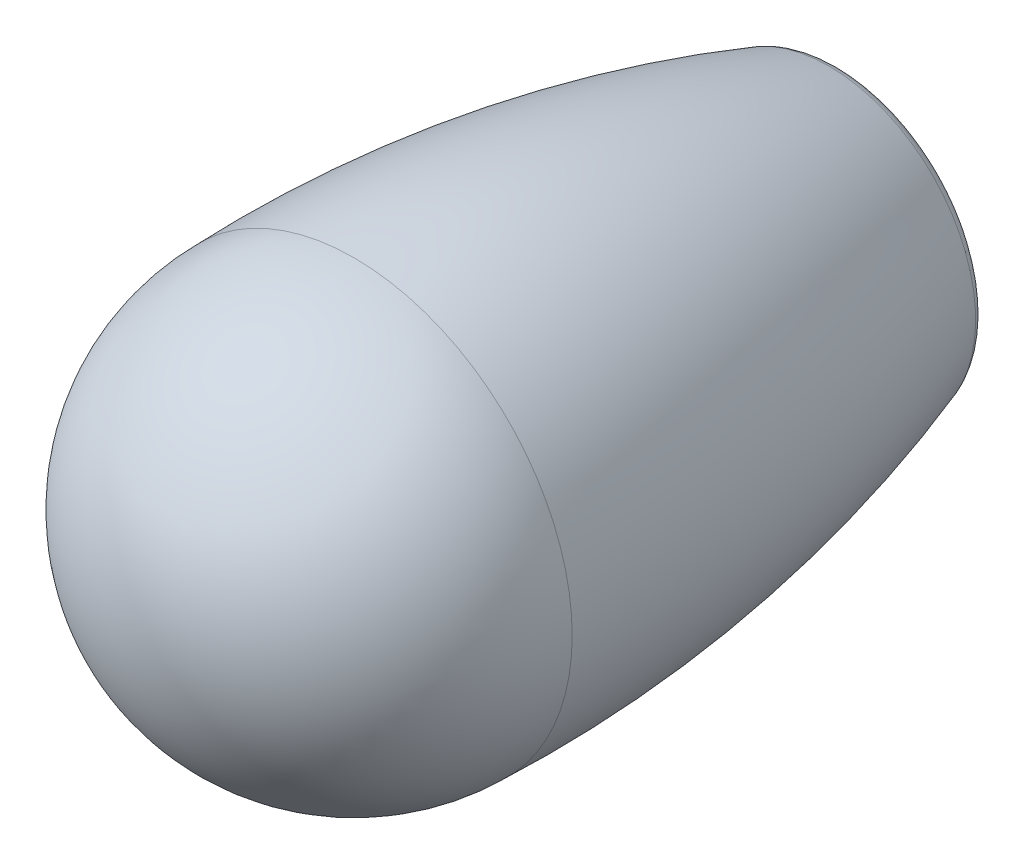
ISO-10303-21;
HEADER;
FILE_DESCRIPTION(('STEP AP214'),'2;1');
FILE_NAME('part.step','',(''),(''),'','','');
FILE_SCHEMA(('AUTOMOTIVE_DESIGN { 1 0 10303 214 1 1 1 1 }'));
ENDSEC;
DATA;
#1=APPLICATION_CONTEXT('core data for automotive mechanical design processes');
#2=APPLICATION_PROTOCOL_DEFINITION('international standard','automotive_design',2000,#1);
#3=PRODUCT_CONTEXT('',#1,'mechanical');
#4=PRODUCT('Part','Part','',(#3));
#5=PRODUCT_RELATED_PRODUCT_CATEGORY('part','',(#4));
#6=PRODUCT_DEFINITION_FORMATION('','',#4);
#7=PRODUCT_DEFINITION_CONTEXT('part definition',#1,'design');
#8=PRODUCT_DEFINITION('design','',#6,#7);
#9=PRODUCT_DEFINITION_SHAPE('','',#8);
#10=(LENGTH_UNIT() NAMED_UNIT(*) SI_UNIT(.MILLI.,.METRE.));
#11=(NAMED_UNIT(*) PLANE_ANGLE_UNIT() SI_UNIT($,.RADIAN.));
#12=(NAMED_UNIT(*) SI_UNIT($,.STERADIAN.) SOLID_ANGLE_UNIT());
#13=UNCERTAINTY_MEASURE_WITH_UNIT(LENGTH_MEASURE(1.E-05),#10,'distance_accuracy_value','');
#14=(GEOMETRIC_REPRESENTATION_CONTEXT(3) GLOBAL_UNCERTAINTY_ASSIGNED_CONTEXT((#13)) GLOBAL_UNIT_ASSIGNED_CONTEXT((#10,
#11,#12)) REPRESENTATION_CONTEXT('',''));
#15=CARTESIAN_POINT('',(0.,0.,0.));
#16=DIRECTION('',(0.,0.,1.));
#17=DIRECTION('',(1.,0.,0.));
#18=AXIS2_PLACEMENT_3D('',#15,#16,#17);
#19=CARTESIAN_POINT('',(0.,0.,1.));
#20=DIRECTION('',(0.,0.,-1.));
#21=DIRECTION('',(0.,1.,0.));
#22=AXIS2_PLACEMENT_3D('',#19,#20,#21);
#23=TOROIDAL_SURFACE('',#22,7.78846659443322,1.);
#24=CARTESIAN_POINT('',(0.,0.,0.676469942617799));
#25=DIRECTION('',(0.,0.,-1.));
#26=DIRECTION('',(0.,1.,0.));
#27=AXIS2_PLACEMENT_3D('',#24,#25,#26);
#28=CIRCLE('',#27,8.73468448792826);
#29=CARTESIAN_POINT('',(0.,8.73468448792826,0.676469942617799));
#30=VERTEX_POINT('',#29);
#31=EDGE_CURVE('E8',#30,#30,#28,.T.);
#32=ORIENTED_EDGE('',*,*,#31,.T.);
#33=EDGE_LOOP('',(#32));
#34=FACE_BOUND('',#33,.T.);
#35=CARTESIAN_POINT('',(0.,0.,0.));
#36=DIRECTION('',(0.,0.,-1.));
#37=DIRECTION('',(0.,1.,0.));
#38=AXIS2_PLACEMENT_3D('',#35,#36,#37);
#39=CIRCLE('',#38,7.78846659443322);
#40=CARTESIAN_POINT('',(0.,7.78846659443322,0.));
#41=VERTEX_POINT('',#40);
#42=EDGE_CURVE('E22',#41,#41,#39,.T.);
#43=ORIENTED_EDGE('',*,*,#42,.F.);
#44=EDGE_LOOP('',(#43));
#45=FACE_BOUND('',#44,.T.);
#46=ADVANCED_FACE('F12',(#34,#45),#23,.T.);
#47=CARTESIAN_POINT('',(0.,0.,26.5588745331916));
#48=DIRECTION('',(0.,0.,-1.));
#49=DIRECTION('',(0.,1.,0.));
#50=AXIS2_PLACEMENT_3D('',#47,#48,#49);
#51=DEGENERATE_TOROIDAL_SURFACE('',#50,66.9627469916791,80.,.F.);
#52=CARTESIAN_POINT('',(0.,0.,29.0000000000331));
#53=DIRECTION('',(0.,0.,-1.));
#54=DIRECTION('',(0.,1.,0.));
#55=AXIS2_PLACEMENT_3D('',#52,#53,#54);
#56=CIRCLE('',#55,12.9999999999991);
#57=CARTESIAN_POINT('',(0.,12.9999999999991,29.0000000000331));
#58=VERTEX_POINT('',#57);
#59=EDGE_CURVE('E18',#58,#58,#56,.T.);
#60=ORIENTED_EDGE('',*,*,#59,.T.);
#61=EDGE_LOOP('',(#60));
#62=FACE_BOUND('',#61,.T.);
#63=ORIENTED_EDGE('',*,*,#31,.F.);
#64=EDGE_LOOP('',(#63));
#65=FACE_BOUND('',#64,.T.);
#66=ADVANCED_FACE('F69',(#62,#65),#51,.F.);
#67=CARTESIAN_POINT('',(-1.66533453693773E-13,0.,29.));
#68=DIRECTION('',(0.,0.,-1.));
#69=DIRECTION('',(1.,0.,0.));
#70=AXIS2_PLACEMENT_3D('',#67,#68,#69);
#71=SPHERICAL_SURFACE('',#70,12.9999999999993);
#72=ORIENTED_EDGE('',*,*,#59,.F.);
#73=EDGE_LOOP('',(#72));
#74=FACE_BOUND('',#73,.T.);
#75=ADVANCED_FACE('F64',(#74),#71,.T.);
#76=CARTESIAN_POINT('',(0.,0.,0.));
#77=DIRECTION('',(0.,0.,-1.));
#78=DIRECTION('',(0.,1.,0.));
#79=AXIS2_PLACEMENT_3D('',#76,#77,#78);
#80=PLANE('',#79);
#81=CARTESIAN_POINT('',(0.,0.,0.));
#82=DIRECTION('',(0.,0.,-1.));
#83=DIRECTION('',(0.,1.,0.));
#84=AXIS2_PLACEMENT_3D('',#81,#82,#83);
#85=CIRCLE('',#84,5.);
#86=CARTESIAN_POINT('',(0.,5.,0.));
#87=VERTEX_POINT('',#86);
#88=EDGE_CURVE('E31',#87,#87,#85,.T.);
#89=ORIENTED_EDGE('',*,*,#88,.F.);
#90=EDGE_LOOP('',(#89));
#91=FACE_BOUND('',#90,.T.);
#92=ORIENTED_EDGE('',*,*,#42,.T.);
#93=EDGE_LOOP('',(#92));
#94=FACE_BOUND('',#93,.T.);
#95=ADVANCED_FACE('F58',(#91,#94),#80,.T.);
#96=CARTESIAN_POINT('',(0.,0.,30.));
#97=DIRECTION('',(0.,0.,-1.));
#98=DIRECTION('',(0.,1.,0.));
#99=AXIS2_PLACEMENT_3D('',#96,#97,#98);
#100=CYLINDRICAL_SURFACE('',#99,5.);
#101=CARTESIAN_POINT('',(0.,0.,30.));
#102=DIRECTION('',(0.,0.,-1.));
#103=DIRECTION('',(0.,1.,0.));
#104=AXIS2_PLACEMENT_3D('',#101,#102,#103);
#105=CIRCLE('',#104,5.);
#106=CARTESIAN_POINT('',(0.,5.,30.));
#107=VERTEX_POINT('',#106);
#108=EDGE_CURVE('E26',#107,#107,#105,.T.);
#109=ORIENTED_EDGE('',*,*,#108,.F.);
#110=EDGE_LOOP('',(#109));
#111=FACE_BOUND('',#110,.T.);
#112=ORIENTED_EDGE('',*,*,#88,.T.);
#113=EDGE_LOOP('',(#112));
#114=FACE_BOUND('',#113,.T.);
#115=ADVANCED_FACE('F52',(#111,#114),#100,.F.);
#116=CARTESIAN_POINT('',(0.,0.,30.));
#117=DIRECTION('',(0.,0.,-1.));
#118=DIRECTION('',(0.,1.,0.));
#119=AXIS2_PLACEMENT_3D('',#116,#117,#118);
#120=PLANE('',#119);
#121=CARTESIAN_POINT('',(0.,0.,30.));
#122=DIRECTION('',(0.,0.,-1.));
#123=DIRECTION('',(-1.,0.,0.));
#124=AXIS2_PLACEMENT_3D('',#121,#122,#123);
#125=CIRCLE('',#124,3.75);
#126=CARTESIAN_POINT('',(-3.75,0.,30.));
#127=VERTEX_POINT('',#126);
#128=EDGE_CURVE('E35',#127,#127,#125,.T.);
#129=ORIENTED_EDGE('',*,*,#128,.F.);
#130=EDGE_LOOP('',(#129));
#131=FACE_BOUND('',#130,.T.);
#132=ORIENTED_EDGE('',*,*,#108,.T.);
#133=EDGE_LOOP('',(#132));
#134=FACE_BOUND('',#133,.T.);
#135=ADVANCED_FACE('F46',(#131,#134),#120,.T.);
#136=CARTESIAN_POINT('',(0.,0.,38.));
#137=DIRECTION('',(0.,0.,-1.));
#138=DIRECTION('',(-1.,0.,0.));
#139=AXIS2_PLACEMENT_3D('',#136,#137,#138);
#140=CYLINDRICAL_SURFACE('',#139,3.75);
#141=CARTESIAN_POINT('',(0.,0.,38.));
#142=DIRECTION('',(0.,0.,-1.));
#143=DIRECTION('',(-1.,0.,0.));
#144=AXIS2_PLACEMENT_3D('',#141,#142,#143);
#145=CIRCLE('',#144,3.75);
#146=CARTESIAN_POINT('',(-3.75,0.,38.));
#147=VERTEX_POINT('',#146);
#148=EDGE_CURVE('E34',#147,#147,#145,.T.);
#149=ORIENTED_EDGE('',*,*,#148,.F.);
#150=EDGE_LOOP('',(#149));
#151=FACE_BOUND('',#150,.T.);
#152=ORIENTED_EDGE('',*,*,#128,.T.);
#153=EDGE_LOOP('',(#152));
#154=FACE_BOUND('',#153,.T.);
#155=ADVANCED_FACE('F43',(#151,#154),#140,.F.);
#156=CARTESIAN_POINT('',(0.,0.,38.));
#157=DIRECTION('',(0.,0.,-1.));
#158=DIRECTION('',(-1.,0.,0.));
#159=AXIS2_PLACEMENT_3D('',#156,#157,#158);
#160=PLANE('',#159);
#161=ORIENTED_EDGE('',*,*,#148,.T.);
#162=EDGE_LOOP('',(#161));
#163=FACE_BOUND('',#162,.T.);
#164=ADVANCED_FACE('F41',(#163),#160,.T.);
#165=CLOSED_SHELL('',(#46,#66,#75,#95,#115,#135,#155,#164));
#166=MANIFOLD_SOLID_BREP('B1',#165);
#167=ADVANCED_BREP_SHAPE_REPRESENTATION('',(#18,#166),#14);
#168=SHAPE_DEFINITION_REPRESENTATION(#9,#167);
ENDSEC;
END-ISO-10303-21;
